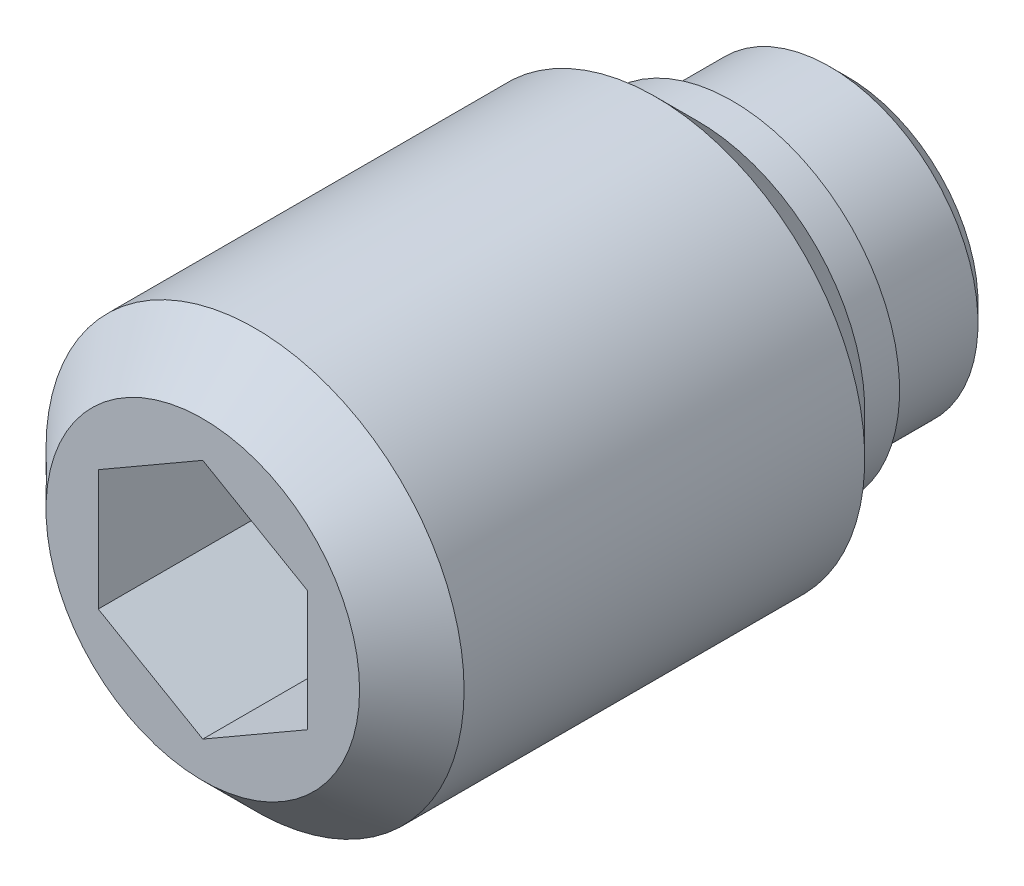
ISO-10303-21;
HEADER;
FILE_DESCRIPTION(('STEP AP214'),'2;1');
FILE_NAME('part.step','',(''),(''),'','','');
FILE_SCHEMA(('AUTOMOTIVE_DESIGN { 1 0 10303 214 1 1 1 1 }'));
ENDSEC;
DATA;
#1=APPLICATION_CONTEXT('core data for automotive mechanical design processes');
#2=APPLICATION_PROTOCOL_DEFINITION('international standard','automotive_design',2000,#1);
#3=PRODUCT_CONTEXT('',#1,'mechanical');
#4=PRODUCT('Part','Part','',(#3));
#5=PRODUCT_RELATED_PRODUCT_CATEGORY('part','',(#4));
#6=PRODUCT_DEFINITION_FORMATION('','',#4);
#7=PRODUCT_DEFINITION_CONTEXT('part definition',#1,'design');
#8=PRODUCT_DEFINITION('design','',#6,#7);
#9=PRODUCT_DEFINITION_SHAPE('','',#8);
#10=(LENGTH_UNIT() NAMED_UNIT(*) SI_UNIT(.MILLI.,.METRE.));
#11=(NAMED_UNIT(*) PLANE_ANGLE_UNIT() SI_UNIT($,.RADIAN.));
#12=(NAMED_UNIT(*) SI_UNIT($,.STERADIAN.) SOLID_ANGLE_UNIT());
#13=UNCERTAINTY_MEASURE_WITH_UNIT(LENGTH_MEASURE(1.E-05),#10,'distance_accuracy_value','');
#14=(GEOMETRIC_REPRESENTATION_CONTEXT(3) GLOBAL_UNCERTAINTY_ASSIGNED_CONTEXT((#13)) GLOBAL_UNIT_ASSIGNED_CONTEXT((#10,
#11,#12)) REPRESENTATION_CONTEXT('',''));
#15=CARTESIAN_POINT('',(0.,0.,0.));
#16=DIRECTION('',(0.,0.,1.));
#17=DIRECTION('',(1.,0.,0.));
#18=AXIS2_PLACEMENT_3D('',#15,#16,#17);
#19=CARTESIAN_POINT('',(0.,0.,3.3));
#20=DIRECTION('',(0.,0.,-1.));
#21=DIRECTION('',(-1.,0.,0.));
#22=AXIS2_PLACEMENT_3D('',#19,#20,#21);
#23=CYLINDRICAL_SURFACE('',#22,6.);
#24=CARTESIAN_POINT('',(0.,0.,5.5));
#25=DIRECTION('',(0.,0.,-1.));
#26=DIRECTION('',(-1.,0.,0.));
#27=AXIS2_PLACEMENT_3D('',#24,#25,#26);
#28=CIRCLE('',#27,6.);
#29=CARTESIAN_POINT('',(-6.,0.,5.5));
#30=VERTEX_POINT('',#29);
#31=EDGE_CURVE('E9',#30,#30,#28,.T.);
#32=ORIENTED_EDGE('',*,*,#31,.F.);
#33=EDGE_LOOP('',(#32));
#34=FACE_BOUND('',#33,.T.);
#35=CARTESIAN_POINT('',(0.,0.,17.));
#36=DIRECTION('',(0.,0.,1.));
#37=DIRECTION('',(1.,0.,0.));
#38=AXIS2_PLACEMENT_3D('',#35,#36,#37);
#39=CIRCLE('',#38,6.);
#40=CARTESIAN_POINT('',(6.,0.,17.));
#41=VERTEX_POINT('',#40);
#42=EDGE_CURVE('E123',#41,#41,#39,.T.);
#43=ORIENTED_EDGE('',*,*,#42,.F.);
#44=EDGE_LOOP('',(#43));
#45=FACE_BOUND('',#44,.T.);
#46=ADVANCED_FACE('F14',(#34,#45),#23,.T.);
#47=CARTESIAN_POINT('',(0.,0.,5.5));
#48=DIRECTION('',(0.,0.,1.));
#49=DIRECTION('',(1.,0.,0.));
#50=AXIS2_PLACEMENT_3D('',#47,#48,#49);
#51=CONICAL_SURFACE('',#50,6.,0.785398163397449);
#52=ORIENTED_EDGE('',*,*,#31,.T.);
#53=EDGE_LOOP('',(#52));
#54=FACE_BOUND('',#53,.T.);
#55=CARTESIAN_POINT('',(0.,0.,4.3));
#56=DIRECTION('',(0.,0.,-1.));
#57=DIRECTION('',(-1.,0.,0.));
#58=AXIS2_PLACEMENT_3D('',#55,#56,#57);
#59=CIRCLE('',#58,4.8);
#60=CARTESIAN_POINT('',(-4.8,0.,4.3));
#61=VERTEX_POINT('',#60);
#62=EDGE_CURVE('E21',#61,#61,#59,.T.);
#63=ORIENTED_EDGE('',*,*,#62,.F.);
#64=EDGE_LOOP('',(#63));
#65=FACE_BOUND('',#64,.T.);
#66=ADVANCED_FACE('F143',(#54,#65),#51,.T.);
#67=CARTESIAN_POINT('',(0.,0.,3.3));
#68=DIRECTION('',(0.,0.,-1.));
#69=DIRECTION('',(-1.,0.,0.));
#70=AXIS2_PLACEMENT_3D('',#67,#68,#69);
#71=CYLINDRICAL_SURFACE('',#70,4.8);
#72=ORIENTED_EDGE('',*,*,#62,.T.);
#73=EDGE_LOOP('',(#72));
#74=FACE_BOUND('',#73,.T.);
#75=CARTESIAN_POINT('',(0.,0.,3.3));
#76=DIRECTION('',(0.,0.,-1.));
#77=DIRECTION('',(-1.,0.,0.));
#78=AXIS2_PLACEMENT_3D('',#75,#76,#77);
#79=CIRCLE('',#78,4.8);
#80=CARTESIAN_POINT('',(-4.8,0.,3.3));
#81=VERTEX_POINT('',#80);
#82=EDGE_CURVE('E135',#81,#81,#79,.T.);
#83=ORIENTED_EDGE('',*,*,#82,.F.);
#84=EDGE_LOOP('',(#83));
#85=FACE_BOUND('',#84,.T.);
#86=ADVANCED_FACE('F140',(#74,#85),#71,.T.);
#87=CARTESIAN_POINT('',(0.,4.8,3.3));
#88=DIRECTION('',(0.,0.,1.));
#89=DIRECTION('',(1.,0.,0.));
#90=AXIS2_PLACEMENT_3D('',#87,#88,#89);
#91=PLANE('',#90);
#92=ORIENTED_EDGE('',*,*,#82,.T.);
#93=EDGE_LOOP('',(#92));
#94=FACE_BOUND('',#93,.T.);
#95=CARTESIAN_POINT('',(0.,0.,3.3));
#96=DIRECTION('',(0.,0.,-1.));
#97=DIRECTION('',(-1.,0.,0.));
#98=AXIS2_PLACEMENT_3D('',#95,#96,#97);
#99=CIRCLE('',#98,4.25);
#100=CARTESIAN_POINT('',(-4.25,0.,3.3));
#101=VERTEX_POINT('',#100);
#102=EDGE_CURVE('E132',#101,#101,#99,.T.);
#103=ORIENTED_EDGE('',*,*,#102,.F.);
#104=EDGE_LOOP('',(#103));
#105=FACE_BOUND('',#104,.T.);
#106=ADVANCED_FACE('F151',(#94,#105),#91,.F.);
#107=CARTESIAN_POINT('',(0.,0.,0.));
#108=DIRECTION('',(0.,0.,-1.));
#109=DIRECTION('',(-1.,0.,0.));
#110=AXIS2_PLACEMENT_3D('',#107,#108,#109);
#111=CYLINDRICAL_SURFACE('',#110,4.25);
#112=CARTESIAN_POINT('',(0.,0.,0.5));
#113=DIRECTION('',(0.,0.,-1.));
#114=DIRECTION('',(-1.,0.,0.));
#115=AXIS2_PLACEMENT_3D('',#112,#113,#114);
#116=CIRCLE('',#115,4.25);
#117=CARTESIAN_POINT('',(-4.25,0.,0.5));
#118=VERTEX_POINT('',#117);
#119=EDGE_CURVE('E129',#118,#118,#116,.T.);
#120=ORIENTED_EDGE('',*,*,#119,.F.);
#121=EDGE_LOOP('',(#120));
#122=FACE_BOUND('',#121,.T.);
#123=ORIENTED_EDGE('',*,*,#102,.T.);
#124=EDGE_LOOP('',(#123));
#125=FACE_BOUND('',#124,.T.);
#126=ADVANCED_FACE('F157',(#122,#125),#111,.T.);
#127=CARTESIAN_POINT('',(0.,0.,0.5));
#128=DIRECTION('',(0.,0.,1.));
#129=DIRECTION('',(1.,0.,0.));
#130=AXIS2_PLACEMENT_3D('',#127,#128,#129);
#131=CONICAL_SURFACE('',#130,4.25,0.785398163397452);
#132=CARTESIAN_POINT('',(0.,0.,0.));
#133=DIRECTION('',(0.,0.,-1.));
#134=DIRECTION('',(-1.,0.,0.));
#135=AXIS2_PLACEMENT_3D('',#132,#133,#134);
#136=CIRCLE('',#135,3.75);
#137=CARTESIAN_POINT('',(-3.75,0.,0.));
#138=VERTEX_POINT('',#137);
#139=EDGE_CURVE('E126',#138,#138,#136,.T.);
#140=ORIENTED_EDGE('',*,*,#139,.F.);
#141=EDGE_LOOP('',(#140));
#142=FACE_BOUND('',#141,.T.);
#143=ORIENTED_EDGE('',*,*,#119,.T.);
#144=EDGE_LOOP('',(#143));
#145=FACE_BOUND('',#144,.T.);
#146=ADVANCED_FACE('F161',(#142,#145),#131,.T.);
#147=CARTESIAN_POINT('',(0.,3.75,0.));
#148=DIRECTION('',(0.,0.,1.));
#149=DIRECTION('',(1.,0.,0.));
#150=AXIS2_PLACEMENT_3D('',#147,#148,#149);
#151=PLANE('',#150);
#152=ORIENTED_EDGE('',*,*,#139,.T.);
#153=EDGE_LOOP('',(#152));
#154=FACE_BOUND('',#153,.T.);
#155=ADVANCED_FACE('F165',(#154),#151,.F.);
#156=CARTESIAN_POINT('',(0.,0.,18.5));
#157=DIRECTION('',(0.,0.,-1.));
#158=DIRECTION('',(-1.,0.,0.));
#159=AXIS2_PLACEMENT_3D('',#156,#157,#158);
#160=CONICAL_SURFACE('',#159,4.5,0.785398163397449);
#161=ORIENTED_EDGE('',*,*,#42,.T.);
#162=EDGE_LOOP('',(#161));
#163=FACE_BOUND('',#162,.T.);
#164=CARTESIAN_POINT('',(0.,0.,18.5));
#165=DIRECTION('',(0.,0.,1.));
#166=DIRECTION('',(1.,0.,0.));
#167=AXIS2_PLACEMENT_3D('',#164,#165,#166);
#168=CIRCLE('',#167,4.5);
#169=CARTESIAN_POINT('',(4.5,0.,18.5));
#170=VERTEX_POINT('',#169);
#171=EDGE_CURVE('E115',#170,#170,#168,.T.);
#172=ORIENTED_EDGE('',*,*,#171,.F.);
#173=EDGE_LOOP('',(#172));
#174=FACE_BOUND('',#173,.T.);
#175=ADVANCED_FACE('F169',(#163,#174),#160,.T.);
#176=CARTESIAN_POINT('',(0.,-4.5,18.5));
#177=DIRECTION('',(0.,0.,1.));
#178=DIRECTION('',(1.,0.,0.));
#179=AXIS2_PLACEMENT_3D('',#176,#177,#178);
#180=PLANE('',#179);
#181=DIRECTION('',(0.866025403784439,-0.5,0.));
#182=VECTOR('',#181,1.);
#183=CARTESIAN_POINT('',(-3.,-1.73205080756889,18.5));
#184=LINE('',#183,#182);
#185=CARTESIAN_POINT('',(-3.,-1.73205080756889,18.5));
#186=VERTEX_POINT('',#185);
#187=CARTESIAN_POINT('',(0.,-3.46410161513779,18.5));
#188=VERTEX_POINT('',#187);
#189=EDGE_CURVE('E28',#186,#188,#184,.T.);
#190=ORIENTED_EDGE('',*,*,#189,.F.);
#191=DIRECTION('',(0.,-1.,0.));
#192=VECTOR('',#191,1.);
#193=CARTESIAN_POINT('',(-3.,1.73205080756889,18.5));
#194=LINE('',#193,#192);
#195=CARTESIAN_POINT('',(-3.,1.73205080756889,18.5));
#196=VERTEX_POINT('',#195);
#197=EDGE_CURVE('E111',#196,#186,#194,.T.);
#198=ORIENTED_EDGE('',*,*,#197,.F.);
#199=DIRECTION('',(-0.866025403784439,-0.5,0.));
#200=VECTOR('',#199,1.);
#201=CARTESIAN_POINT('',(0.,3.46410161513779,18.5));
#202=LINE('',#201,#200);
#203=CARTESIAN_POINT('',(0.,3.46410161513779,18.5));
#204=VERTEX_POINT('',#203);
#205=EDGE_CURVE('E109',#204,#196,#202,.T.);
#206=ORIENTED_EDGE('',*,*,#205,.F.);
#207=DIRECTION('',(-0.866025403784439,0.5,0.));
#208=VECTOR('',#207,1.);
#209=CARTESIAN_POINT('',(3.,1.73205080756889,18.5));
#210=LINE('',#209,#208);
#211=CARTESIAN_POINT('',(3.,1.73205080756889,18.5));
#212=VERTEX_POINT('',#211);
#213=EDGE_CURVE('E76',#212,#204,#210,.T.);
#214=ORIENTED_EDGE('',*,*,#213,.F.);
#215=DIRECTION('',(0.,1.,0.));
#216=VECTOR('',#215,1.);
#217=CARTESIAN_POINT('',(3.,-1.73205080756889,18.5));
#218=LINE('',#217,#216);
#219=CARTESIAN_POINT('',(3.,-1.73205080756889,18.5));
#220=VERTEX_POINT('',#219);
#221=EDGE_CURVE('E105',#220,#212,#218,.T.);
#222=ORIENTED_EDGE('',*,*,#221,.F.);
#223=DIRECTION('',(0.866025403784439,0.5,0.));
#224=VECTOR('',#223,1.);
#225=CARTESIAN_POINT('',(0.,-3.46410161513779,18.5));
#226=LINE('',#225,#224);
#227=EDGE_CURVE('E102',#188,#220,#226,.T.);
#228=ORIENTED_EDGE('',*,*,#227,.F.);
#229=EDGE_LOOP('',(#190,#198,#206,#214,#222,#228));
#230=FACE_BOUND('',#229,.T.);
#231=ORIENTED_EDGE('',*,*,#171,.T.);
#232=EDGE_LOOP('',(#231));
#233=FACE_BOUND('',#232,.T.);
#234=ADVANCED_FACE('F173',(#230,#233),#180,.T.);
#235=CARTESIAN_POINT('',(-3.,-1.73205080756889,13.5));
#236=DIRECTION('',(-0.5,-0.866025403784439,0.));
#237=DIRECTION('',(0.866025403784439,-0.5,0.));
#238=AXIS2_PLACEMENT_3D('',#235,#236,#237);
#239=PLANE('',#238);
#240=ORIENTED_EDGE('',*,*,#189,.T.);
#241=DIRECTION('',(0.,0.,1.));
#242=VECTOR('',#241,1.);
#243=CARTESIAN_POINT('',(0.,-3.46410161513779,13.5));
#244=LINE('',#243,#242);
#245=CARTESIAN_POINT('',(0.,-3.46410161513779,13.5));
#246=VERTEX_POINT('',#245);
#247=EDGE_CURVE('E58',#246,#188,#244,.T.);
#248=ORIENTED_EDGE('',*,*,#247,.F.);
#249=DIRECTION('',(0.866025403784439,-0.5,0.));
#250=VECTOR('',#249,1.);
#251=CARTESIAN_POINT('',(-3.,-1.73205080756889,13.5));
#252=LINE('',#251,#250);
#253=CARTESIAN_POINT('',(-3.,-1.73205080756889,13.5));
#254=VERTEX_POINT('',#253);
#255=EDGE_CURVE('E113',#254,#246,#252,.T.);
#256=ORIENTED_EDGE('',*,*,#255,.F.);
#257=DIRECTION('',(0.,0.,1.));
#258=VECTOR('',#257,1.);
#259=CARTESIAN_POINT('',(-3.,-1.73205080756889,13.5));
#260=LINE('',#259,#258);
#261=EDGE_CURVE('E36',#254,#186,#260,.T.);
#262=ORIENTED_EDGE('',*,*,#261,.T.);
#263=EDGE_LOOP('',(#240,#248,#256,#262));
#264=FACE_BOUND('',#263,.T.);
#265=ADVANCED_FACE('F177',(#264),#239,.F.);
#266=CARTESIAN_POINT('',(-3.,1.73205080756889,13.5));
#267=DIRECTION('',(-1.,0.,0.));
#268=DIRECTION('',(0.,0.,1.));
#269=AXIS2_PLACEMENT_3D('',#266,#267,#268);
#270=PLANE('',#269);
#271=ORIENTED_EDGE('',*,*,#197,.T.);
#272=ORIENTED_EDGE('',*,*,#261,.F.);
#273=DIRECTION('',(0.,-1.,0.));
#274=VECTOR('',#273,1.);
#275=CARTESIAN_POINT('',(-3.,1.73205080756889,13.5));
#276=LINE('',#275,#274);
#277=CARTESIAN_POINT('',(-3.,1.73205080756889,13.5));
#278=VERTEX_POINT('',#277);
#279=EDGE_CURVE('E88',#278,#254,#276,.T.);
#280=ORIENTED_EDGE('',*,*,#279,.F.);
#281=DIRECTION('',(0.,0.,1.));
#282=VECTOR('',#281,1.);
#283=CARTESIAN_POINT('',(-3.,1.73205080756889,13.5));
#284=LINE('',#283,#282);
#285=EDGE_CURVE('E80',#278,#196,#284,.T.);
#286=ORIENTED_EDGE('',*,*,#285,.T.);
#287=EDGE_LOOP('',(#271,#272,#280,#286));
#288=FACE_BOUND('',#287,.T.);
#289=ADVANCED_FACE('F181',(#288),#270,.F.);
#290=CARTESIAN_POINT('',(0.,3.46410161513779,13.5));
#291=DIRECTION('',(-0.5,0.866025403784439,0.));
#292=DIRECTION('',(-0.866025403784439,-0.5,0.));
#293=AXIS2_PLACEMENT_3D('',#290,#291,#292);
#294=PLANE('',#293);
#295=ORIENTED_EDGE('',*,*,#205,.T.);
#296=ORIENTED_EDGE('',*,*,#285,.F.);
#297=DIRECTION('',(-0.866025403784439,-0.5,0.));
#298=VECTOR('',#297,1.);
#299=CARTESIAN_POINT('',(0.,3.46410161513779,13.5));
#300=LINE('',#299,#298);
#301=CARTESIAN_POINT('',(0.,3.46410161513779,13.5));
#302=VERTEX_POINT('',#301);
#303=EDGE_CURVE('E84',#302,#278,#300,.T.);
#304=ORIENTED_EDGE('',*,*,#303,.F.);
#305=DIRECTION('',(0.,0.,1.));
#306=VECTOR('',#305,1.);
#307=CARTESIAN_POINT('',(0.,3.46410161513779,13.5));
#308=LINE('',#307,#306);
#309=EDGE_CURVE('E69',#302,#204,#308,.T.);
#310=ORIENTED_EDGE('',*,*,#309,.T.);
#311=EDGE_LOOP('',(#295,#296,#304,#310));
#312=FACE_BOUND('',#311,.T.);
#313=ADVANCED_FACE('F85',(#312),#294,.F.);
#314=CARTESIAN_POINT('',(3.,1.73205080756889,13.5));
#315=DIRECTION('',(0.5,0.866025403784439,0.));
#316=DIRECTION('',(-0.866025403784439,0.5,0.));
#317=AXIS2_PLACEMENT_3D('',#314,#315,#316);
#318=PLANE('',#317);
#319=ORIENTED_EDGE('',*,*,#213,.T.);
#320=ORIENTED_EDGE('',*,*,#309,.F.);
#321=DIRECTION('',(-0.866025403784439,0.5,0.));
#322=VECTOR('',#321,1.);
#323=CARTESIAN_POINT('',(3.,1.73205080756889,13.5));
#324=LINE('',#323,#322);
#325=CARTESIAN_POINT('',(3.,1.73205080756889,13.5));
#326=VERTEX_POINT('',#325);
#327=EDGE_CURVE('E73',#326,#302,#324,.T.);
#328=ORIENTED_EDGE('',*,*,#327,.F.);
#329=DIRECTION('',(0.,0.,1.));
#330=VECTOR('',#329,1.);
#331=CARTESIAN_POINT('',(3.,1.73205080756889,13.5));
#332=LINE('',#331,#330);
#333=EDGE_CURVE('E81',#326,#212,#332,.T.);
#334=ORIENTED_EDGE('',*,*,#333,.T.);
#335=EDGE_LOOP('',(#319,#320,#328,#334));
#336=FACE_BOUND('',#335,.T.);
#337=ADVANCED_FACE('F71',(#336),#318,.F.);
#338=CARTESIAN_POINT('',(3.,-1.73205080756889,13.5));
#339=DIRECTION('',(1.,0.,0.));
#340=DIRECTION('',(0.,0.,-1.));
#341=AXIS2_PLACEMENT_3D('',#338,#339,#340);
#342=PLANE('',#341);
#343=ORIENTED_EDGE('',*,*,#221,.T.);
#344=ORIENTED_EDGE('',*,*,#333,.F.);
#345=DIRECTION('',(0.,1.,0.));
#346=VECTOR('',#345,1.);
#347=CARTESIAN_POINT('',(3.,-1.73205080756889,13.5));
#348=LINE('',#347,#346);
#349=CARTESIAN_POINT('',(3.,-1.73205080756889,13.5));
#350=VERTEX_POINT('',#349);
#351=EDGE_CURVE('E94',#350,#326,#348,.T.);
#352=ORIENTED_EDGE('',*,*,#351,.F.);
#353=DIRECTION('',(0.,0.,1.));
#354=VECTOR('',#353,1.);
#355=CARTESIAN_POINT('',(3.,-1.73205080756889,13.5));
#356=LINE('',#355,#354);
#357=EDGE_CURVE('E118',#350,#220,#356,.T.);
#358=ORIENTED_EDGE('',*,*,#357,.T.);
#359=EDGE_LOOP('',(#343,#344,#352,#358));
#360=FACE_BOUND('',#359,.T.);
#361=ADVANCED_FACE('F185',(#360),#342,.F.);
#362=CARTESIAN_POINT('',(0.,-3.46410161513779,13.5));
#363=DIRECTION('',(0.5,-0.866025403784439,0.));
#364=DIRECTION('',(0.866025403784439,0.5,0.));
#365=AXIS2_PLACEMENT_3D('',#362,#363,#364);
#366=PLANE('',#365);
#367=ORIENTED_EDGE('',*,*,#227,.T.);
#368=ORIENTED_EDGE('',*,*,#357,.F.);
#369=DIRECTION('',(0.866025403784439,0.5,0.));
#370=VECTOR('',#369,1.);
#371=CARTESIAN_POINT('',(0.,-3.46410161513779,13.5));
#372=LINE('',#371,#370);
#373=EDGE_CURVE('E96',#246,#350,#372,.T.);
#374=ORIENTED_EDGE('',*,*,#373,.F.);
#375=ORIENTED_EDGE('',*,*,#247,.T.);
#376=EDGE_LOOP('',(#367,#368,#374,#375));
#377=FACE_BOUND('',#376,.T.);
#378=ADVANCED_FACE('F182',(#377),#366,.F.);
#379=CARTESIAN_POINT('',(0.,0.,13.5));
#380=DIRECTION('',(0.,0.,1.));
#381=DIRECTION('',(1.,0.,0.));
#382=AXIS2_PLACEMENT_3D('',#379,#380,#381);
#383=PLANE('',#382);
#384=ORIENTED_EDGE('',*,*,#255,.T.);
#385=ORIENTED_EDGE('',*,*,#373,.T.);
#386=ORIENTED_EDGE('',*,*,#351,.T.);
#387=ORIENTED_EDGE('',*,*,#327,.T.);
#388=ORIENTED_EDGE('',*,*,#303,.T.);
#389=ORIENTED_EDGE('',*,*,#279,.T.);
#390=EDGE_LOOP('',(#384,#385,#386,#387,#388,#389));
#391=FACE_BOUND('',#390,.T.);
#392=ADVANCED_FACE('F91',(#391),#383,.T.);
#393=CLOSED_SHELL('',(#46,#66,#86,#106,#126,#146,#155,#175,#234,#265,#289,#313,#337,#361,#378,#392));
#394=MANIFOLD_SOLID_BREP('B1',#393);
#395=ADVANCED_BREP_SHAPE_REPRESENTATION('',(#18,#394),#14);
#396=SHAPE_DEFINITION_REPRESENTATION(#9,#395);
ENDSEC;
END-ISO-10303-21;
